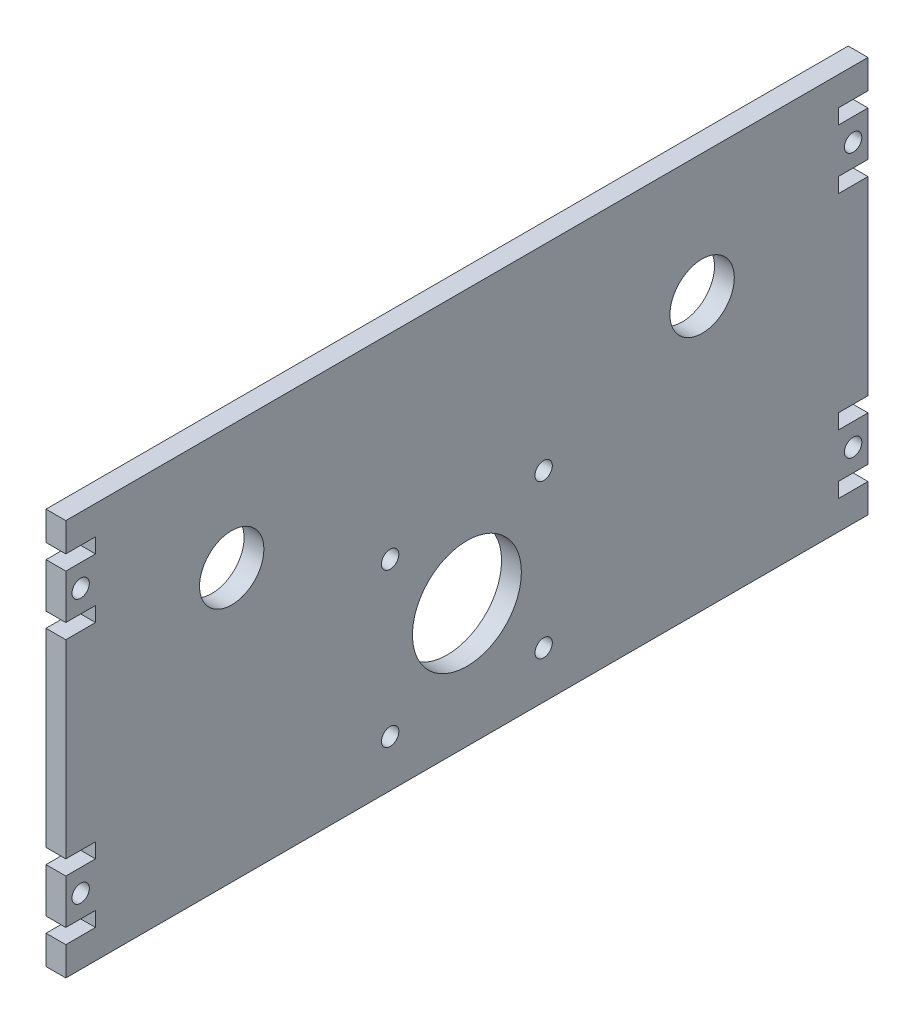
from build123d import *

# Parameters (mm, degrees)
SKETCH1_W           = 162
SKETCH1_H           = 80
BOSS_EXTRUDE1_DEPTH = 2
SKETCH2_R           = 6.5
SKETCH2_R_2         = 11
SKETCH2_R_3         = 1.75
CUT_EXTRUDE1_DEPTH  = 91.426765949
SKETCH3_R           = 1.75
SKETCH3_W           = 6
SKETCH3_H           = 3
CUT_EXTRUDE2_DEPTH  = 91.426765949


with BuildPart() as part:
    # Sketch1 → Boss-Extrude1 (new, symmetric)
    with BuildSketch(Plane(origin=(0, 0, 0), x_dir=(0, 0, -1), z_dir=(1, 0, 0))):
        Rectangle(SKETCH1_W, SKETCH1_H)
    extrude(amount=BOSS_EXTRUDE1_DEPTH, both=True)

    # Sketch2 → Cut-Extrude1 (cut, through all)
    with BuildSketch(Plane(origin=(2, 0, 0), x_dir=(0, 0, -1), z_dir=(1, 0, 0))):
        with Locations((-47.5, 15)):
            Circle(SKETCH2_R)
        with Locations((47.5, 15)):
            Circle(SKETCH2_R)
        with Locations((0, -15)):
            Circle(SKETCH2_R_2)
        with Locations((-15.5, 0.5)):
            Circle(SKETCH2_R_3)
        with Locations((-15.5, -30.5)):
            Circle(SKETCH2_R_3)
        with Locations((15.5, -30.5)):
            Circle(SKETCH2_R_3)
        with Locations((15.5, 0.5)):
            Circle(SKETCH2_R_3)
    extrude(amount=-CUT_EXTRUDE1_DEPTH, mode=Mode.SUBTRACT)

    # Sketch3 → Cut-Extrude2 (cut, through all)
    with BuildSketch(Plane(origin=(2, 0, 0), x_dir=(0, 0, -1), z_dir=(1, 0, 0))):
        with Locations((-78, 26.666666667)):
            Circle(SKETCH3_R)
        with Locations(Location((-78, -26.666666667, 0), (0, 0, 180))):
            Circle(SKETCH3_R)
        with Locations((78, -26.666666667)):
            Circle(SKETCH3_R)
        with Locations(Location((78, 26.666666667, 0), (0, 0, 180))):
            Circle(SKETCH3_R)
        with Locations((-78, 32.666666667)):
            Rectangle(SKETCH3_W, SKETCH3_H)
        with Locations((-78, 20.666666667)):
            Rectangle(SKETCH3_W, SKETCH3_H)
        with Locations((-78, -20.666666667)):
            Rectangle(SKETCH3_W, SKETCH3_H)
        with Locations((-78, -32.666666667)):
            Rectangle(SKETCH3_W, SKETCH3_H)
        with Locations((78, -32.666666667)):
            Rectangle(SKETCH3_W, SKETCH3_H)
        with Locations((78, -20.666666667)):
            Rectangle(SKETCH3_W, SKETCH3_H)
        with Locations((78, 20.666666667)):
            Rectangle(SKETCH3_W, SKETCH3_H)
        with Locations((78, 32.666666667)):
            Rectangle(SKETCH3_W, SKETCH3_H)
    extrude(amount=-CUT_EXTRUDE2_DEPTH, mode=Mode.SUBTRACT)


solid = part.part
